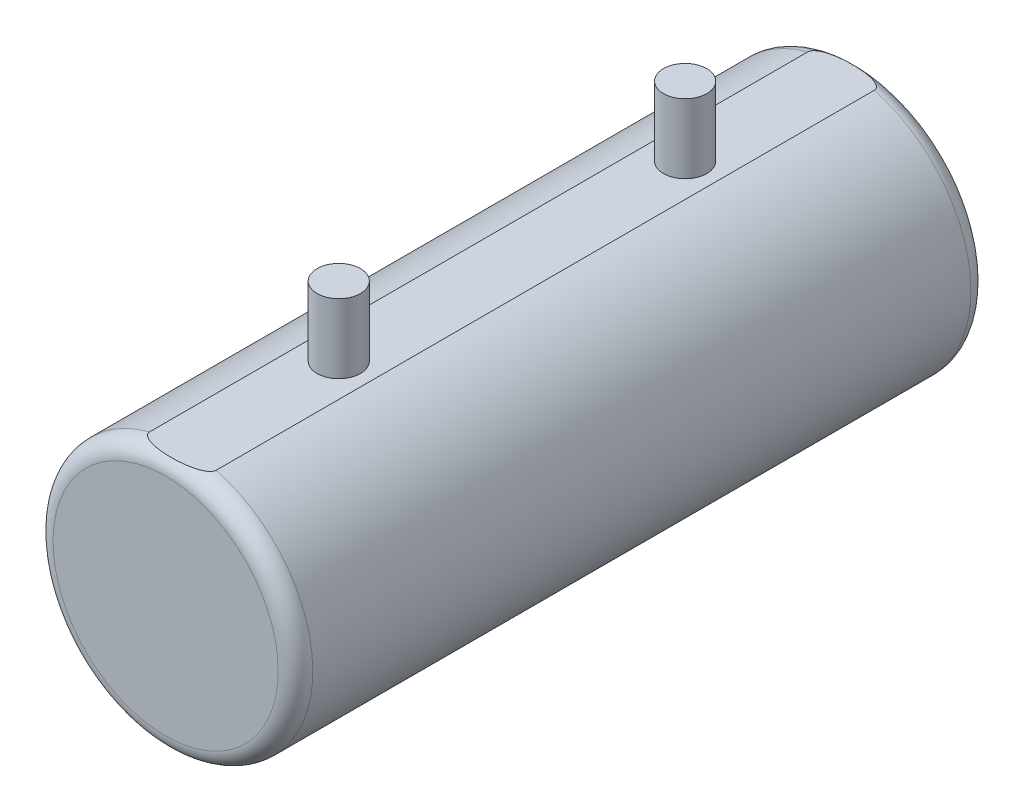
ISO-10303-21;
HEADER;
FILE_DESCRIPTION(('STEP AP214'),'2;1');
FILE_NAME('part.step','',(''),(''),'','','');
FILE_SCHEMA(('AUTOMOTIVE_DESIGN { 1 0 10303 214 1 1 1 1 }'));
ENDSEC;
DATA;
#1=APPLICATION_CONTEXT('core data for automotive mechanical design processes');
#2=APPLICATION_PROTOCOL_DEFINITION('international standard','automotive_design',2000,#1);
#3=PRODUCT_CONTEXT('',#1,'mechanical');
#4=PRODUCT('Part','Part','',(#3));
#5=PRODUCT_RELATED_PRODUCT_CATEGORY('part','',(#4));
#6=PRODUCT_DEFINITION_FORMATION('','',#4);
#7=PRODUCT_DEFINITION_CONTEXT('part definition',#1,'design');
#8=PRODUCT_DEFINITION('design','',#6,#7);
#9=PRODUCT_DEFINITION_SHAPE('','',#8);
#10=(LENGTH_UNIT() NAMED_UNIT(*) SI_UNIT(.MILLI.,.METRE.));
#11=(NAMED_UNIT(*) PLANE_ANGLE_UNIT() SI_UNIT($,.RADIAN.));
#12=(NAMED_UNIT(*) SI_UNIT($,.STERADIAN.) SOLID_ANGLE_UNIT());
#13=UNCERTAINTY_MEASURE_WITH_UNIT(LENGTH_MEASURE(1.E-05),#10,'distance_accuracy_value','');
#14=(GEOMETRIC_REPRESENTATION_CONTEXT(3) GLOBAL_UNCERTAINTY_ASSIGNED_CONTEXT((#13)) GLOBAL_UNIT_ASSIGNED_CONTEXT((#10,
#11,#12)) REPRESENTATION_CONTEXT('',''));
#15=CARTESIAN_POINT('',(0.,0.,0.));
#16=DIRECTION('',(0.,0.,1.));
#17=DIRECTION('',(1.,0.,0.));
#18=AXIS2_PLACEMENT_3D('',#15,#16,#17);
#19=CARTESIAN_POINT('',(-7.34557144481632,14.5,-40.));
#20=DIRECTION('',(0.,-1.,0.));
#21=DIRECTION('',(0.,0.,-1.));
#22=AXIS2_PLACEMENT_3D('',#19,#20,#21);
#23=PLANE('',#22);
#24=CARTESIAN_POINT('',(0.,14.5,-20.));
#25=DIRECTION('',(0.,-1.,0.));
#26=DIRECTION('',(0.,0.,-1.));
#27=AXIS2_PLACEMENT_3D('',#24,#25,#26);
#28=CIRCLE('',#27,2.5);
#29=CARTESIAN_POINT('',(0.,14.5,-22.5));
#30=VERTEX_POINT('',#29);
#31=EDGE_CURVE('E43',#30,#30,#28,.F.);
#32=ORIENTED_EDGE('',*,*,#31,.F.);
#33=EDGE_LOOP('',(#32));
#34=FACE_BOUND('',#33,.T.);
#35=DIRECTION('',(0.,0.,-1.));
#36=VECTOR('',#35,1.);
#37=CARTESIAN_POINT('',(3.8405728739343,14.5,40.));
#38=LINE('',#37,#36);
#39=CARTESIAN_POINT('',(3.8405728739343,14.5,-38.));
#40=VERTEX_POINT('',#39);
#41=CARTESIAN_POINT('',(3.8405728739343,14.5,37.9999999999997));
#42=VERTEX_POINT('',#41);
#43=EDGE_CURVE('E83',#40,#42,#38,.F.);
#44=ORIENTED_EDGE('',*,*,#43,.F.);
#45=CARTESIAN_POINT('',(3.8405728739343,14.5,-38.));
#46=CARTESIAN_POINT('',(3.84068569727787,14.5,-38.0342097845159));
#47=CARTESIAN_POINT('',(3.83715113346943,14.5,-38.0682694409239));
#48=CARTESIAN_POINT('',(3.82384020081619,14.5,-38.1347236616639));
#49=CARTESIAN_POINT('',(3.81414307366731,14.5,-38.1671338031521));
#50=CARTESIAN_POINT('',(3.78957566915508,14.5,-38.229675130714));
#51=CARTESIAN_POINT('',(3.77473177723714,14.5,-38.2598170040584));
#52=CARTESIAN_POINT('',(3.7409886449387,14.5,-38.3178241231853));
#53=CARTESIAN_POINT('',(3.72207563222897,14.5,-38.3456811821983));
#54=CARTESIAN_POINT('',(3.66440518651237,14.5,-38.4209818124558));
#55=CARTESIAN_POINT('',(3.62211516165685,14.5,-38.4657022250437));
#56=CARTESIAN_POINT('',(3.53151096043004,14.5,-38.5485020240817));
#57=CARTESIAN_POINT('',(3.4831789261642,14.5,-38.5865608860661));
#58=CARTESIAN_POINT('',(3.38186789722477,14.5,-38.6578933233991));
#59=CARTESIAN_POINT('',(3.32882155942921,14.5,-38.6910697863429));
#60=CARTESIAN_POINT('',(3.22013644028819,14.5,-38.7529172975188));
#61=CARTESIAN_POINT('',(3.16449493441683,14.5,-38.781583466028));
#62=CARTESIAN_POINT('',(3.05134991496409,14.5,-38.8352440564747));
#63=CARTESIAN_POINT('',(2.9938428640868,14.5,-38.8602309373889));
#64=CARTESIAN_POINT('',(2.87760832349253,14.5,-38.9070612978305));
#65=CARTESIAN_POINT('',(2.81888141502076,14.5,-38.928906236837));
#66=CARTESIAN_POINT('',(2.66547579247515,14.5,-38.9820895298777));
#67=CARTESIAN_POINT('',(2.57009287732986,14.5,-39.0113932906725));
#68=CARTESIAN_POINT('',(2.37782586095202,14.5,-39.0646449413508));
#69=CARTESIAN_POINT('',(2.28094101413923,14.5,-39.088590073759));
#70=CARTESIAN_POINT('',(2.08601864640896,14.5,-39.1320776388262));
#71=CARTESIAN_POINT('',(1.98797939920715,14.5,-39.1516122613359));
#72=CARTESIAN_POINT('',(1.79121606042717,14.5,-39.1868938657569));
#73=CARTESIAN_POINT('',(1.69249185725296,14.5,-39.2026402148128));
#74=CARTESIAN_POINT('',(1.39466985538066,14.5,-39.2450985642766));
#75=CARTESIAN_POINT('',(1.1948560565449,14.5,-39.2668329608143));
#76=CARTESIAN_POINT('',(0.794623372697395,14.5,-39.2995620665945));
#77=CARTESIAN_POINT('',(0.594205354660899,14.5,-39.3105681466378));
#78=CARTESIAN_POINT('',(0.171679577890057,14.5,-39.3236827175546));
#79=CARTESIAN_POINT('',(-0.0504621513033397,14.5,-39.3247172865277));
#80=CARTESIAN_POINT('',(-0.494667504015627,14.5,-39.315213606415));
#81=CARTESIAN_POINT('',(-0.716730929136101,14.5,-39.3046662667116));
#82=CARTESIAN_POINT('',(-1.15901266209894,14.5,-39.2707431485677));
#83=CARTESIAN_POINT('',(-1.37923480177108,14.5,-39.2474216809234));
#84=CARTESIAN_POINT('',(-1.70772471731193,14.5,-39.2004057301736));
#85=CARTESIAN_POINT('',(-1.81686190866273,14.5,-39.1827395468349));
#86=CARTESIAN_POINT('',(-2.03425911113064,14.5,-39.1426922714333));
#87=CARTESIAN_POINT('',(-2.14251933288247,14.5,-39.1203123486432));
#88=CARTESIAN_POINT('',(-2.33721845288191,14.5,-39.0746831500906));
#89=CARTESIAN_POINT('',(-2.42388516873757,14.5,-39.0524118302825));
#90=CARTESIAN_POINT('',(-2.59601987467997,14.5,-39.0034116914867));
#91=CARTESIAN_POINT('',(-2.68148718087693,14.5,-38.9766804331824));
#92=CARTESIAN_POINT('',(-2.85063888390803,14.5,-38.9177435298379));
#93=CARTESIAN_POINT('',(-2.93432132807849,14.5,-38.8855322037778));
#94=CARTESIAN_POINT('',(-3.09865874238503,14.5,-38.8142293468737));
#95=CARTESIAN_POINT('',(-3.17931753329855,14.5,-38.7751468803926));
#96=CARTESIAN_POINT('',(-3.33660505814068,14.5,-38.6874559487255));
#97=CARTESIAN_POINT('',(-3.41317502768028,14.5,-38.6387405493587));
#98=CARTESIAN_POINT('',(-3.55663651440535,14.5,-38.5288483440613));
#99=CARTESIAN_POINT('',(-3.62360758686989,14.5,-38.4677854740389));
#100=CARTESIAN_POINT('',(-3.702602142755,14.5,-38.3721426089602));
#101=CARTESIAN_POINT('',(-3.72299328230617,14.5,-38.3445388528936));
#102=CARTESIAN_POINT('',(-3.75991936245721,14.5,-38.2868274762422));
#103=CARTESIAN_POINT('',(-3.77645585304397,14.5,-38.2567208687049));
#104=CARTESIAN_POINT('',(-3.80465488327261,14.5,-38.1938414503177));
#105=CARTESIAN_POINT('',(-3.8162601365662,14.5,-38.1610423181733));
#106=CARTESIAN_POINT('',(-3.83307867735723,14.5,-38.0938266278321));
#107=CARTESIAN_POINT('',(-3.83829955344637,14.5,-38.0594120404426));
#108=CARTESIAN_POINT('',(-3.84148355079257,14.5,-37.9935282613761));
#109=CARTESIAN_POINT('',(-3.84008627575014,14.5,-37.9620882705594));
#110=CARTESIAN_POINT('',(-3.83173191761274,14.5,-37.8997467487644));
#111=CARTESIAN_POINT('',(-3.82473948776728,14.5,-37.8688499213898));
#112=CARTESIAN_POINT('',(-3.8150914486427,14.5,-37.8388366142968));
#113=B_SPLINE_CURVE_WITH_KNOTS('',3,(#45,#46,#47,#48,#49,#50,#51,#52,#53,#54,#55,#56,#57,#58,
#59,#60,#61,#62,#63,#64,#65,#66,#67,#68,#69,#70,#71,#72,#73,#74,#75,#76,#77,#78,#79,#80,#81,#82,
#83,#84,#85,#86,#87,#88,#89,#90,#91,#92,#93,#94,#95,#96,#97,#98,#99,#100,#101,#102,#103,#104,
#105,#106,#107,#108,#109,#110,#111,#112),.UNSPECIFIED.,.F.,.F.,(4,2,2,2,2,2,2,2,2,2,2,2,2,2,2,2,
2,2,2,2,2,2,2,2,2,2,2,2,2,2,2,2,2,4),(0.,0.102209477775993,0.203130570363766,0.303541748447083,
0.404298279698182,0.587879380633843,0.772016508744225,0.959427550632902,1.14703998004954,
1.33503173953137,1.52293589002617,1.82206586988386,2.12134942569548,2.4211588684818,
2.721018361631,3.32359289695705,3.92552807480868,4.59164938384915,5.2582939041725,
5.92212585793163,6.25372189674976,6.58523577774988,6.85359022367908,7.12209192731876,
7.39087369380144,7.6593035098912,7.93089983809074,8.20009586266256,8.30281187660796,
8.40548651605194,8.50932331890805,8.61303657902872,8.70694282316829,8.80144703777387),.UNSPECIFIED.);
#114=CARTESIAN_POINT('',(-3.8405728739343,14.5,-37.9999999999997));
#115=VERTEX_POINT('',#114);
#116=EDGE_CURVE('E74',#40,#115,#113,.T.);
#117=ORIENTED_EDGE('',*,*,#116,.T.);
#118=DIRECTION('',(0.,0.,-1.));
#119=VECTOR('',#118,1.);
#120=CARTESIAN_POINT('',(-3.8405728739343,14.5,40.));
#121=LINE('',#120,#119);
#122=CARTESIAN_POINT('',(-3.8405728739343,14.5,38.));
#123=VERTEX_POINT('',#122);
#124=EDGE_CURVE('E81',#123,#115,#121,.T.);
#125=ORIENTED_EDGE('',*,*,#124,.F.);
#126=CARTESIAN_POINT('',(-3.8405728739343,14.5,38.));
#127=CARTESIAN_POINT('',(-3.84068569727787,14.5,38.0342097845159));
#128=CARTESIAN_POINT('',(-3.83715113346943,14.5,38.0682694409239));
#129=CARTESIAN_POINT('',(-3.8238402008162,14.5,38.1347236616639));
#130=CARTESIAN_POINT('',(-3.81414307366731,14.5,38.1671338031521));
#131=CARTESIAN_POINT('',(-3.78957566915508,14.5,38.229675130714));
#132=CARTESIAN_POINT('',(-3.77473177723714,14.5,38.2598170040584));
#133=CARTESIAN_POINT('',(-3.74098864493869,14.5,38.3178241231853));
#134=CARTESIAN_POINT('',(-3.72207563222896,14.5,38.3456811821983));
#135=CARTESIAN_POINT('',(-3.66440518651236,14.5,38.4209818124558));
#136=CARTESIAN_POINT('',(-3.62211516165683,14.5,38.4657022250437));
#137=CARTESIAN_POINT('',(-3.53151096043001,14.5,38.5485020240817));
#138=CARTESIAN_POINT('',(-3.48317892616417,14.5,38.5865608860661));
#139=CARTESIAN_POINT('',(-3.38186789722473,14.5,38.6578933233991));
#140=CARTESIAN_POINT('',(-3.32882155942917,14.5,38.691069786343));
#141=CARTESIAN_POINT('',(-3.22013644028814,14.5,38.7529172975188));
#142=CARTESIAN_POINT('',(-3.16449493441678,14.5,38.7815834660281));
#143=CARTESIAN_POINT('',(-3.05134991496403,14.5,38.8352440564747));
#144=CARTESIAN_POINT('',(-2.99384286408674,14.5,38.8602309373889));
#145=CARTESIAN_POINT('',(-2.87760832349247,14.5,38.9070612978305));
#146=CARTESIAN_POINT('',(-2.81888141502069,14.5,38.928906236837));
#147=CARTESIAN_POINT('',(-2.66547579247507,14.5,38.9820895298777));
#148=CARTESIAN_POINT('',(-2.57009287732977,14.5,39.0113932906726));
#149=CARTESIAN_POINT('',(-2.37782586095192,14.5,39.0646449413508));
#150=CARTESIAN_POINT('',(-2.28094101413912,14.5,39.088590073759));
#151=CARTESIAN_POINT('',(-2.08601864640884,14.5,39.1320776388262));
#152=CARTESIAN_POINT('',(-1.98797939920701,14.5,39.1516122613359));
#153=CARTESIAN_POINT('',(-1.79121606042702,14.5,39.1868938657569));
#154=CARTESIAN_POINT('',(-1.69249185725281,14.5,39.2026402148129));
#155=CARTESIAN_POINT('',(-1.39466985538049,14.5,39.2450985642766));
#156=CARTESIAN_POINT('',(-1.19485605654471,14.5,39.2668329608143));
#157=CARTESIAN_POINT('',(-0.794623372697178,14.5,39.2995620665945));
#158=CARTESIAN_POINT('',(-0.594205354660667,14.5,39.3105681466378));
#159=CARTESIAN_POINT('',(-0.1716795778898,14.5,39.3236827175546));
#160=CARTESIAN_POINT('',(0.050462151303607,14.5,39.3247172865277));
#161=CARTESIAN_POINT('',(0.494667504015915,14.5,39.315213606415));
#162=CARTESIAN_POINT('',(0.716730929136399,14.5,39.3046662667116));
#163=CARTESIAN_POINT('',(1.15901266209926,14.5,39.2707431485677));
#164=CARTESIAN_POINT('',(1.37923480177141,14.5,39.2474216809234));
#165=CARTESIAN_POINT('',(1.70772471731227,14.5,39.2004057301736));
#166=CARTESIAN_POINT('',(1.81686190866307,14.5,39.1827395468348));
#167=CARTESIAN_POINT('',(2.03425911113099,14.5,39.1426922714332));
#168=CARTESIAN_POINT('',(2.14251933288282,14.5,39.1203123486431));
#169=CARTESIAN_POINT('',(2.33721845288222,14.5,39.0746831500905));
#170=CARTESIAN_POINT('',(2.42388516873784,14.5,39.0524118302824));
#171=CARTESIAN_POINT('',(2.59601987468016,14.5,39.0034116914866));
#172=CARTESIAN_POINT('',(2.68148718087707,14.5,38.9766804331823));
#173=CARTESIAN_POINT('',(2.85063888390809,14.5,38.9177435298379));
#174=CARTESIAN_POINT('',(2.93432132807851,14.5,38.8855322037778));
#175=CARTESIAN_POINT('',(3.09865874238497,14.5,38.8142293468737));
#176=CARTESIAN_POINT('',(3.17931753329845,14.5,38.7751468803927));
#177=CARTESIAN_POINT('',(3.33660505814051,14.5,38.6874559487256));
#178=CARTESIAN_POINT('',(3.41317502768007,14.5,38.6387405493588));
#179=CARTESIAN_POINT('',(3.55663651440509,14.5,38.5288483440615));
#180=CARTESIAN_POINT('',(3.62360758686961,14.5,38.4677854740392));
#181=CARTESIAN_POINT('',(3.70260214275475,14.5,38.3721426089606));
#182=CARTESIAN_POINT('',(3.72299328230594,14.5,38.3445388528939));
#183=CARTESIAN_POINT('',(3.75991936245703,14.5,38.2868274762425));
#184=CARTESIAN_POINT('',(3.7764558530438,14.5,38.2567208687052));
#185=CARTESIAN_POINT('',(3.80465488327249,14.5,38.193841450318));
#186=CARTESIAN_POINT('',(3.8162601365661,14.5,38.1610423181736));
#187=CARTESIAN_POINT('',(3.83307867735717,14.5,38.0938266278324));
#188=CARTESIAN_POINT('',(3.83829955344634,14.5,38.0594120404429));
#189=CARTESIAN_POINT('',(3.84148355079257,14.5,37.9935282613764));
#190=CARTESIAN_POINT('',(3.84008627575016,14.5,37.9620882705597));
#191=CARTESIAN_POINT('',(3.83173191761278,14.5,37.8997467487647));
#192=CARTESIAN_POINT('',(3.82473948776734,14.5,37.8688499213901));
#193=CARTESIAN_POINT('',(3.81509144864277,14.5,37.838836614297));
#194=B_SPLINE_CURVE_WITH_KNOTS('',3,(#126,#127,#128,#129,#130,#131,#132,#133,#134,#135,#136,
#137,#138,#139,#140,#141,#142,#143,#144,#145,#146,#147,#148,#149,#150,#151,#152,#153,#154,#155,
#156,#157,#158,#159,#160,#161,#162,#163,#164,#165,#166,#167,#168,#169,#170,#171,#172,#173,#174,
#175,#176,#177,#178,#179,#180,#181,#182,#183,#184,#185,#186,#187,#188,#189,#190,#191,#192,#193),
.UNSPECIFIED.,.F.,.F.,(4,2,2,2,2,2,2,2,2,2,2,2,2,2,2,2,2,2,2,2,2,2,2,2,2,2,2,2,2,2,2,2,2,4),(0.,
0.102209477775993,0.203130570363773,0.303541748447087,0.404298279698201,0.587879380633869,
0.772016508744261,0.959427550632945,1.14703998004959,1.33503173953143,1.52293589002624,
1.82206586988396,2.12134942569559,2.42115886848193,2.72101836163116,3.32359289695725,
3.92552807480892,4.59164938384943,5.2582939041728,5.92212585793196,6.2537218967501,
6.58523577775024,6.85359022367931,7.12209192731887,7.39087369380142,7.65930350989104,
7.93089983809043,8.20009586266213,8.30281187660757,8.40548651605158,8.50932331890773,
8.61303657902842,8.70694282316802,8.80144703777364),.UNSPECIFIED.);
#195=EDGE_CURVE('E67',#123,#42,#194,.T.);
#196=ORIENTED_EDGE('',*,*,#195,.T.);
#197=EDGE_LOOP('',(#44,#117,#125,#196));
#198=FACE_BOUND('',#197,.T.);
#199=CARTESIAN_POINT('',(0.,14.5,20.));
#200=DIRECTION('',(0.,-1.,0.));
#201=DIRECTION('',(0.,0.,-1.));
#202=AXIS2_PLACEMENT_3D('',#199,#200,#201);
#203=CIRCLE('',#202,2.5);
#204=CARTESIAN_POINT('',(0.,14.5,17.5));
#205=VERTEX_POINT('',#204);
#206=EDGE_CURVE('E11',#205,#205,#203,.F.);
#207=ORIENTED_EDGE('',*,*,#206,.F.);
#208=EDGE_LOOP('',(#207));
#209=FACE_BOUND('',#208,.T.);
#210=ADVANCED_FACE('F34',(#34,#198,#209),#23,.F.);
#211=CARTESIAN_POINT('',(0.,0.,40.));
#212=DIRECTION('',(0.,0.,-1.));
#213=DIRECTION('',(-1.,0.,0.));
#214=AXIS2_PLACEMENT_3D('',#211,#212,#213);
#215=CYLINDRICAL_SURFACE('',#214,15.);
#216=ORIENTED_EDGE('',*,*,#124,.T.);
#217=CARTESIAN_POINT('',(0.,0.,-38.));
#218=DIRECTION('',(0.,0.,1.));
#219=DIRECTION('',(1.,0.,0.));
#220=AXIS2_PLACEMENT_3D('',#217,#218,#219);
#221=CIRCLE('',#220,15.);
#222=EDGE_CURVE('E75',#115,#40,#221,.T.);
#223=ORIENTED_EDGE('',*,*,#222,.T.);
#224=ORIENTED_EDGE('',*,*,#43,.T.);
#225=CARTESIAN_POINT('',(0.,0.,38.));
#226=DIRECTION('',(0.,0.,1.));
#227=DIRECTION('',(1.,0.,0.));
#228=AXIS2_PLACEMENT_3D('',#225,#226,#227);
#229=CIRCLE('',#228,15.);
#230=EDGE_CURVE('E69',#42,#123,#229,.F.);
#231=ORIENTED_EDGE('',*,*,#230,.T.);
#232=EDGE_LOOP('',(#216,#223,#224,#231));
#233=FACE_BOUND('',#232,.T.);
#234=ADVANCED_FACE('F79',(#233),#215,.T.);
#235=CARTESIAN_POINT('',(0.,0.,40.));
#236=DIRECTION('',(0.,0.,1.));
#237=DIRECTION('',(1.,0.,0.));
#238=AXIS2_PLACEMENT_3D('',#235,#236,#237);
#239=PLANE('',#238);
#240=CARTESIAN_POINT('',(0.,0.,40.));
#241=DIRECTION('',(0.,0.,1.));
#242=DIRECTION('',(1.,0.,0.));
#243=AXIS2_PLACEMENT_3D('',#240,#241,#242);
#244=CIRCLE('',#243,13.);
#245=CARTESIAN_POINT('',(-3.32849649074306,12.5666666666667,40.));
#246=VERTEX_POINT('',#245);
#247=EDGE_CURVE('E48',#246,#246,#244,.T.);
#248=ORIENTED_EDGE('',*,*,#247,.T.);
#249=EDGE_LOOP('',(#248));
#250=FACE_BOUND('',#249,.T.);
#251=ADVANCED_FACE('F107',(#250),#239,.T.);
#252=CARTESIAN_POINT('',(0.,0.,-40.));
#253=DIRECTION('',(0.,0.,1.));
#254=DIRECTION('',(1.,0.,0.));
#255=AXIS2_PLACEMENT_3D('',#252,#253,#254);
#256=PLANE('',#255);
#257=CARTESIAN_POINT('',(0.,0.,-40.));
#258=DIRECTION('',(0.,0.,1.));
#259=DIRECTION('',(1.,0.,0.));
#260=AXIS2_PLACEMENT_3D('',#257,#258,#259);
#261=CIRCLE('',#260,13.);
#262=CARTESIAN_POINT('',(-3.32849649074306,12.5666666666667,-40.));
#263=VERTEX_POINT('',#262);
#264=EDGE_CURVE('E53',#263,#263,#261,.F.);
#265=ORIENTED_EDGE('',*,*,#264,.T.);
#266=EDGE_LOOP('',(#265));
#267=FACE_BOUND('',#266,.T.);
#268=ADVANCED_FACE('F111',(#267),#256,.F.);
#269=CARTESIAN_POINT('',(0.,0.,-38.));
#270=DIRECTION('',(0.,0.,1.));
#271=DIRECTION('',(1.,0.,0.));
#272=AXIS2_PLACEMENT_3D('',#269,#270,#271);
#273=TOROIDAL_SURFACE('',#272,13.,2.);
#274=ORIENTED_EDGE('',*,*,#264,.F.);
#275=EDGE_LOOP('',(#274));
#276=FACE_BOUND('',#275,.T.);
#277=ORIENTED_EDGE('',*,*,#116,.F.);
#278=ORIENTED_EDGE('',*,*,#222,.F.);
#279=EDGE_LOOP('',(#277,#278));
#280=FACE_BOUND('',#279,.T.);
#281=ADVANCED_FACE('F115',(#276,#280),#273,.T.);
#282=CARTESIAN_POINT('',(0.,0.,38.));
#283=DIRECTION('',(0.,0.,1.));
#284=DIRECTION('',(1.,0.,0.));
#285=AXIS2_PLACEMENT_3D('',#282,#283,#284);
#286=TOROIDAL_SURFACE('',#285,13.,2.);
#287=ORIENTED_EDGE('',*,*,#195,.F.);
#288=ORIENTED_EDGE('',*,*,#230,.F.);
#289=EDGE_LOOP('',(#287,#288));
#290=FACE_BOUND('',#289,.T.);
#291=ORIENTED_EDGE('',*,*,#247,.F.);
#292=EDGE_LOOP('',(#291));
#293=FACE_BOUND('',#292,.T.);
#294=ADVANCED_FACE('F36',(#290,#293),#286,.T.);
#295=CARTESIAN_POINT('',(0.,22.5,-20.));
#296=DIRECTION('',(0.,-1.,0.));
#297=DIRECTION('',(0.,0.,-1.));
#298=AXIS2_PLACEMENT_3D('',#295,#296,#297);
#299=CYLINDRICAL_SURFACE('',#298,2.5);
#300=CARTESIAN_POINT('',(0.,22.5,-20.));
#301=DIRECTION('',(0.,1.,0.));
#302=DIRECTION('',(0.,0.,1.));
#303=AXIS2_PLACEMENT_3D('',#300,#301,#302);
#304=CIRCLE('',#303,2.5);
#305=CARTESIAN_POINT('',(0.,22.5,-17.5));
#306=VERTEX_POINT('',#305);
#307=EDGE_CURVE('E87',#306,#306,#304,.T.);
#308=ORIENTED_EDGE('',*,*,#307,.F.);
#309=EDGE_LOOP('',(#308));
#310=FACE_BOUND('',#309,.T.);
#311=ORIENTED_EDGE('',*,*,#31,.T.);
#312=EDGE_LOOP('',(#311));
#313=FACE_BOUND('',#312,.T.);
#314=ADVANCED_FACE('F105',(#310,#313),#299,.T.);
#315=CARTESIAN_POINT('',(0.,22.5,-20.));
#316=DIRECTION('',(0.,1.,0.));
#317=DIRECTION('',(0.,0.,1.));
#318=AXIS2_PLACEMENT_3D('',#315,#316,#317);
#319=PLANE('',#318);
#320=ORIENTED_EDGE('',*,*,#307,.T.);
#321=EDGE_LOOP('',(#320));
#322=FACE_BOUND('',#321,.T.);
#323=ADVANCED_FACE('F129',(#322),#319,.T.);
#324=CARTESIAN_POINT('',(0.,22.5,20.));
#325=DIRECTION('',(0.,-1.,0.));
#326=DIRECTION('',(0.,0.,-1.));
#327=AXIS2_PLACEMENT_3D('',#324,#325,#326);
#328=CYLINDRICAL_SURFACE('',#327,2.5);
#329=CARTESIAN_POINT('',(0.,22.5,20.));
#330=DIRECTION('',(0.,1.,0.));
#331=DIRECTION('',(0.,0.,1.));
#332=AXIS2_PLACEMENT_3D('',#329,#330,#331);
#333=CIRCLE('',#332,2.5);
#334=CARTESIAN_POINT('',(0.,22.5,22.5));
#335=VERTEX_POINT('',#334);
#336=EDGE_CURVE('E138',#335,#335,#333,.T.);
#337=ORIENTED_EDGE('',*,*,#336,.F.);
#338=EDGE_LOOP('',(#337));
#339=FACE_BOUND('',#338,.T.);
#340=ORIENTED_EDGE('',*,*,#206,.T.);
#341=EDGE_LOOP('',(#340));
#342=FACE_BOUND('',#341,.T.);
#343=ADVANCED_FACE('F134',(#339,#342),#328,.T.);
#344=CARTESIAN_POINT('',(0.,22.5,20.));
#345=DIRECTION('',(0.,1.,0.));
#346=DIRECTION('',(0.,0.,1.));
#347=AXIS2_PLACEMENT_3D('',#344,#345,#346);
#348=PLANE('',#347);
#349=ORIENTED_EDGE('',*,*,#336,.T.);
#350=EDGE_LOOP('',(#349));
#351=FACE_BOUND('',#350,.T.);
#352=ADVANCED_FACE('F143',(#351),#348,.T.);
#353=CLOSED_SHELL('',(#210,#234,#251,#268,#281,#294,#314,#323,#343,#352));
#354=MANIFOLD_SOLID_BREP('B2',#353);
#355=ADVANCED_BREP_SHAPE_REPRESENTATION('',(#18,#354),#14);
#356=SHAPE_DEFINITION_REPRESENTATION(#9,#355);
ENDSEC;
END-ISO-10303-21;
